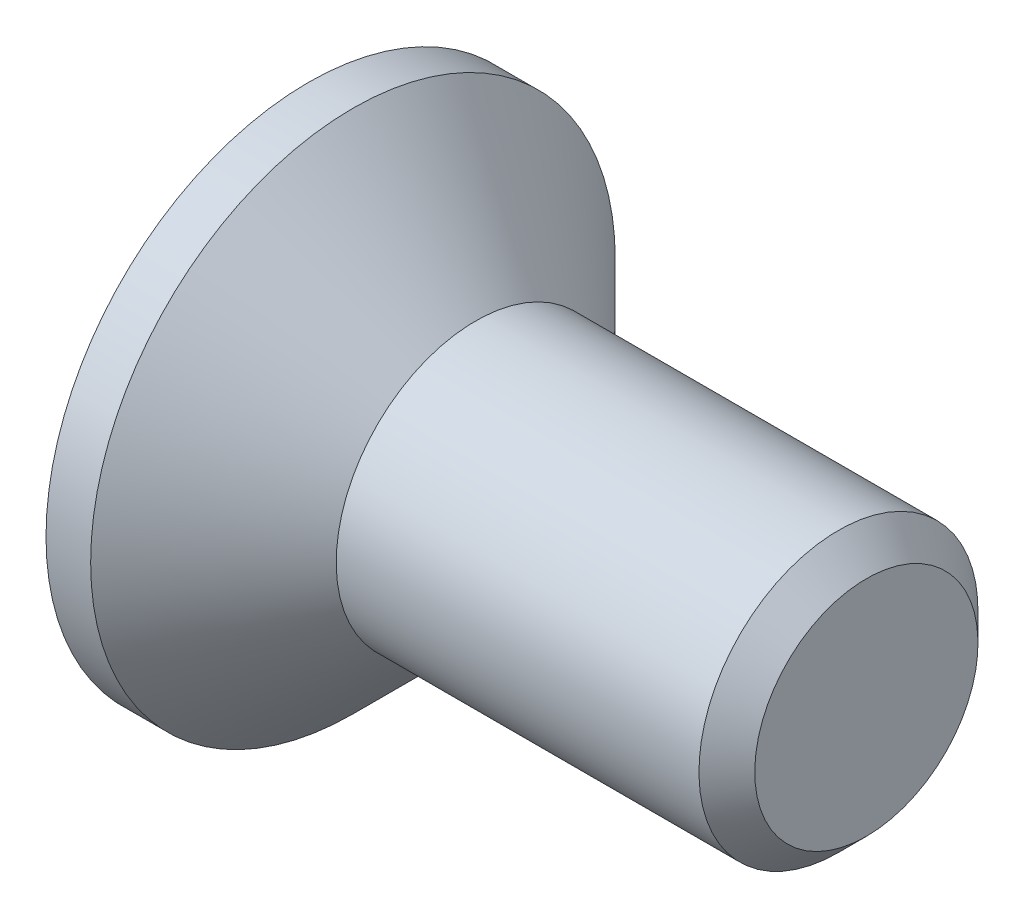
ISO-10303-21;
HEADER;
FILE_DESCRIPTION(('STEP AP214'),'2;1');
FILE_NAME('part.step','',(''),(''),'','','');
FILE_SCHEMA(('AUTOMOTIVE_DESIGN { 1 0 10303 214 1 1 1 1 }'));
ENDSEC;
DATA;
#1=APPLICATION_CONTEXT('core data for automotive mechanical design processes');
#2=APPLICATION_PROTOCOL_DEFINITION('international standard','automotive_design',2000,#1);
#3=PRODUCT_CONTEXT('',#1,'mechanical');
#4=PRODUCT('Part','Part','',(#3));
#5=PRODUCT_RELATED_PRODUCT_CATEGORY('part','',(#4));
#6=PRODUCT_DEFINITION_FORMATION('','',#4);
#7=PRODUCT_DEFINITION_CONTEXT('part definition',#1,'design');
#8=PRODUCT_DEFINITION('design','',#6,#7);
#9=PRODUCT_DEFINITION_SHAPE('','',#8);
#10=(LENGTH_UNIT() NAMED_UNIT(*) SI_UNIT(.MILLI.,.METRE.));
#11=(NAMED_UNIT(*) PLANE_ANGLE_UNIT() SI_UNIT($,.RADIAN.));
#12=(NAMED_UNIT(*) SI_UNIT($,.STERADIAN.) SOLID_ANGLE_UNIT());
#13=UNCERTAINTY_MEASURE_WITH_UNIT(LENGTH_MEASURE(1.E-05),#10,'distance_accuracy_value','');
#14=(GEOMETRIC_REPRESENTATION_CONTEXT(3) GLOBAL_UNCERTAINTY_ASSIGNED_CONTEXT((#13)) GLOBAL_UNIT_ASSIGNED_CONTEXT((#10,
#11,#12)) REPRESENTATION_CONTEXT('',''));
#15=CARTESIAN_POINT('',(0.,0.,0.));
#16=DIRECTION('',(0.,0.,1.));
#17=DIRECTION('',(1.,0.,0.));
#18=AXIS2_PLACEMENT_3D('',#15,#16,#17);
#19=CARTESIAN_POINT('',(0.,0.,0.));
#20=DIRECTION('',(-1.,0.,0.));
#21=DIRECTION('',(0.,-1.,0.));
#22=AXIS2_PLACEMENT_3D('',#19,#20,#21);
#23=CONICAL_SURFACE('',#22,1.25,0.78539816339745);
#24=CARTESIAN_POINT('',(-1.1,0.,0.));
#25=DIRECTION('',(-1.,0.,0.));
#26=DIRECTION('',(0.,-1.,0.));
#27=AXIS2_PLACEMENT_3D('',#24,#25,#26);
#28=CIRCLE('',#27,2.35);
#29=CARTESIAN_POINT('',(-1.1,-2.35,0.));
#30=VERTEX_POINT('',#29);
#31=EDGE_CURVE('E189',#30,#30,#28,.T.);
#32=ORIENTED_EDGE('',*,*,#31,.F.);
#33=EDGE_LOOP('',(#32));
#34=FACE_BOUND('',#33,.T.);
#35=CARTESIAN_POINT('',(0.,0.,0.));
#36=DIRECTION('',(-1.,0.,0.));
#37=DIRECTION('',(0.,-1.,0.));
#38=AXIS2_PLACEMENT_3D('',#35,#36,#37);
#39=CIRCLE('',#38,1.25);
#40=CARTESIAN_POINT('',(0.,-1.25,0.));
#41=VERTEX_POINT('',#40);
#42=EDGE_CURVE('E212',#41,#41,#39,.T.);
#43=ORIENTED_EDGE('',*,*,#42,.T.);
#44=EDGE_LOOP('',(#43));
#45=FACE_BOUND('',#44,.T.);
#46=ADVANCED_FACE('F33',(#34,#45),#23,.T.);
#47=CARTESIAN_POINT('',(-1.5,0.,0.));
#48=DIRECTION('',(-1.,0.,0.));
#49=DIRECTION('',(0.,-1.,0.));
#50=AXIS2_PLACEMENT_3D('',#47,#48,#49);
#51=CYLINDRICAL_SURFACE('',#50,1.25);
#52=CARTESIAN_POINT('',(3.25,0.,0.));
#53=DIRECTION('',(-1.,0.,0.));
#54=DIRECTION('',(0.,-1.,0.));
#55=AXIS2_PLACEMENT_3D('',#52,#53,#54);
#56=CIRCLE('',#55,1.25);
#57=CARTESIAN_POINT('',(3.25,-1.25,0.));
#58=VERTEX_POINT('',#57);
#59=EDGE_CURVE('E41',#58,#58,#56,.T.);
#60=ORIENTED_EDGE('',*,*,#59,.T.);
#61=EDGE_LOOP('',(#60));
#62=FACE_BOUND('',#61,.T.);
#63=ORIENTED_EDGE('',*,*,#42,.F.);
#64=EDGE_LOOP('',(#63));
#65=FACE_BOUND('',#64,.T.);
#66=ADVANCED_FACE('F217',(#62,#65),#51,.T.);
#67=CARTESIAN_POINT('',(3.5,0.,0.));
#68=DIRECTION('',(-1.,0.,0.));
#69=DIRECTION('',(0.,-1.,0.));
#70=AXIS2_PLACEMENT_3D('',#67,#68,#69);
#71=PLANE('',#70);
#72=CARTESIAN_POINT('',(3.5,0.,0.));
#73=DIRECTION('',(-1.,0.,0.));
#74=DIRECTION('',(0.,-1.,0.));
#75=AXIS2_PLACEMENT_3D('',#72,#73,#74);
#76=CIRCLE('',#75,0.999999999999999);
#77=CARTESIAN_POINT('',(3.5,-0.999999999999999,0.));
#78=VERTEX_POINT('',#77);
#79=EDGE_CURVE('E11',#78,#78,#76,.F.);
#80=ORIENTED_EDGE('',*,*,#79,.T.);
#81=EDGE_LOOP('',(#80));
#82=FACE_BOUND('',#81,.T.);
#83=ADVANCED_FACE('F239',(#82),#71,.F.);
#84=CARTESIAN_POINT('',(-1.5,2.35,0.));
#85=DIRECTION('',(1.,0.,0.));
#86=DIRECTION('',(0.,1.,0.));
#87=AXIS2_PLACEMENT_3D('',#84,#85,#86);
#88=PLANE('',#87);
#89=DIRECTION('',(0.,0.,-1.));
#90=VECTOR('',#89,1.);
#91=CARTESIAN_POINT('',(-1.5,0.34,-1.35));
#92=LINE('',#91,#90);
#93=CARTESIAN_POINT('',(-1.5,0.34,-0.34));
#94=VERTEX_POINT('',#93);
#95=CARTESIAN_POINT('',(-1.5,0.34,-1.35));
#96=VERTEX_POINT('',#95);
#97=EDGE_CURVE('E158',#94,#96,#92,.T.);
#98=ORIENTED_EDGE('',*,*,#97,.F.);
#99=DIRECTION('',(0.,-1.,0.));
#100=VECTOR('',#99,1.);
#101=CARTESIAN_POINT('',(-1.5,0.34,-0.34));
#102=LINE('',#101,#100);
#103=CARTESIAN_POINT('',(-1.5,1.35,-0.34));
#104=VERTEX_POINT('',#103);
#105=EDGE_CURVE('E48',#104,#94,#102,.T.);
#106=ORIENTED_EDGE('',*,*,#105,.F.);
#107=DIRECTION('',(0.,0.,-1.));
#108=VECTOR('',#107,1.);
#109=CARTESIAN_POINT('',(-1.5,1.35,-0.34));
#110=LINE('',#109,#108);
#111=CARTESIAN_POINT('',(-1.5,1.35,0.34));
#112=VERTEX_POINT('',#111);
#113=EDGE_CURVE('E185',#112,#104,#110,.T.);
#114=ORIENTED_EDGE('',*,*,#113,.F.);
#115=DIRECTION('',(0.,1.,0.));
#116=VECTOR('',#115,1.);
#117=CARTESIAN_POINT('',(-1.5,1.35,0.34));
#118=LINE('',#117,#116);
#119=CARTESIAN_POINT('',(-1.5,0.34,0.34));
#120=VERTEX_POINT('',#119);
#121=EDGE_CURVE('E183',#120,#112,#118,.T.);
#122=ORIENTED_EDGE('',*,*,#121,.F.);
#123=DIRECTION('',(0.,0.,-1.));
#124=VECTOR('',#123,1.);
#125=CARTESIAN_POINT('',(-1.5,0.34,0.34));
#126=LINE('',#125,#124);
#127=CARTESIAN_POINT('',(-1.5,0.34,1.35));
#128=VERTEX_POINT('',#127);
#129=EDGE_CURVE('E132',#128,#120,#126,.T.);
#130=ORIENTED_EDGE('',*,*,#129,.F.);
#131=DIRECTION('',(0.,1.,0.));
#132=VECTOR('',#131,1.);
#133=CARTESIAN_POINT('',(-1.5,0.34,1.35));
#134=LINE('',#133,#132);
#135=CARTESIAN_POINT('',(-1.5,-0.34,1.35));
#136=VERTEX_POINT('',#135);
#137=EDGE_CURVE('E179',#136,#128,#134,.T.);
#138=ORIENTED_EDGE('',*,*,#137,.F.);
#139=DIRECTION('',(0.,0.,1.));
#140=VECTOR('',#139,1.);
#141=CARTESIAN_POINT('',(-1.5,-0.34,1.35));
#142=LINE('',#141,#140);
#143=CARTESIAN_POINT('',(-1.5,-0.34,0.34));
#144=VERTEX_POINT('',#143);
#145=EDGE_CURVE('E176',#144,#136,#142,.T.);
#146=ORIENTED_EDGE('',*,*,#145,.F.);
#147=DIRECTION('',(0.,1.,0.));
#148=VECTOR('',#147,1.);
#149=CARTESIAN_POINT('',(-1.5,-0.34,0.34));
#150=LINE('',#149,#148);
#151=CARTESIAN_POINT('',(-1.5,-1.35,0.34));
#152=VERTEX_POINT('',#151);
#153=EDGE_CURVE('E173',#152,#144,#150,.T.);
#154=ORIENTED_EDGE('',*,*,#153,.F.);
#155=DIRECTION('',(0.,0.,1.));
#156=VECTOR('',#155,1.);
#157=CARTESIAN_POINT('',(-1.5,-1.35,0.34));
#158=LINE('',#157,#156);
#159=CARTESIAN_POINT('',(-1.5,-1.35,-0.34));
#160=VERTEX_POINT('',#159);
#161=EDGE_CURVE('E170',#160,#152,#158,.T.);
#162=ORIENTED_EDGE('',*,*,#161,.F.);
#163=DIRECTION('',(0.,-1.,0.));
#164=VECTOR('',#163,1.);
#165=CARTESIAN_POINT('',(-1.5,-1.35,-0.34));
#166=LINE('',#165,#164);
#167=CARTESIAN_POINT('',(-1.5,-0.34,-0.34));
#168=VERTEX_POINT('',#167);
#169=EDGE_CURVE('E167',#168,#160,#166,.T.);
#170=ORIENTED_EDGE('',*,*,#169,.F.);
#171=DIRECTION('',(0.,0.,1.));
#172=VECTOR('',#171,1.);
#173=CARTESIAN_POINT('',(-1.5,-0.34,-0.34));
#174=LINE('',#173,#172);
#175=CARTESIAN_POINT('',(-1.5,-0.34,-1.35));
#176=VERTEX_POINT('',#175);
#177=EDGE_CURVE('E164',#176,#168,#174,.T.);
#178=ORIENTED_EDGE('',*,*,#177,.F.);
#179=DIRECTION('',(0.,-1.,0.));
#180=VECTOR('',#179,1.);
#181=CARTESIAN_POINT('',(-1.5,-0.34,-1.35));
#182=LINE('',#181,#180);
#183=EDGE_CURVE('E161',#96,#176,#182,.T.);
#184=ORIENTED_EDGE('',*,*,#183,.F.);
#185=EDGE_LOOP('',(#98,#106,#114,#122,#130,#138,#146,#154,#162,#170,#178,#184));
#186=FACE_BOUND('',#185,.T.);
#187=CARTESIAN_POINT('',(-1.5,0.,0.));
#188=DIRECTION('',(-1.,0.,0.));
#189=DIRECTION('',(0.,-1.,0.));
#190=AXIS2_PLACEMENT_3D('',#187,#188,#189);
#191=CIRCLE('',#190,2.35);
#192=CARTESIAN_POINT('',(-1.5,-2.35,0.));
#193=VERTEX_POINT('',#192);
#194=EDGE_CURVE('E209',#193,#193,#191,.T.);
#195=ORIENTED_EDGE('',*,*,#194,.T.);
#196=EDGE_LOOP('',(#195));
#197=FACE_BOUND('',#196,.T.);
#198=ADVANCED_FACE('F230',(#186,#197),#88,.F.);
#199=CARTESIAN_POINT('',(-1.5,0.,0.));
#200=DIRECTION('',(-1.,0.,0.));
#201=DIRECTION('',(0.,-1.,0.));
#202=AXIS2_PLACEMENT_3D('',#199,#200,#201);
#203=CYLINDRICAL_SURFACE('',#202,2.35);
#204=ORIENTED_EDGE('',*,*,#194,.F.);
#205=EDGE_LOOP('',(#204));
#206=FACE_BOUND('',#205,.T.);
#207=ORIENTED_EDGE('',*,*,#31,.T.);
#208=EDGE_LOOP('',(#207));
#209=FACE_BOUND('',#208,.T.);
#210=ADVANCED_FACE('F222',(#206,#209),#203,.T.);
#211=CARTESIAN_POINT('',(3.25,0.,0.));
#212=DIRECTION('',(-1.,0.,0.));
#213=DIRECTION('',(0.,-1.,0.));
#214=AXIS2_PLACEMENT_3D('',#211,#212,#213);
#215=CONICAL_SURFACE('',#214,1.25,0.785398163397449);
#216=ORIENTED_EDGE('',*,*,#79,.F.);
#217=EDGE_LOOP('',(#216));
#218=FACE_BOUND('',#217,.T.);
#219=ORIENTED_EDGE('',*,*,#59,.F.);
#220=EDGE_LOOP('',(#219));
#221=FACE_BOUND('',#220,.T.);
#222=ADVANCED_FACE('F35',(#218,#221),#215,.T.);
#223=CARTESIAN_POINT('',(-0.25,0.34,-0.34));
#224=DIRECTION('',(0.,0.,-1.));
#225=DIRECTION('',(-1.,0.,0.));
#226=AXIS2_PLACEMENT_3D('',#223,#224,#225);
#227=PLANE('',#226);
#228=ORIENTED_EDGE('',*,*,#105,.T.);
#229=DIRECTION('',(-1.,0.,0.));
#230=VECTOR('',#229,1.);
#231=CARTESIAN_POINT('',(-0.25,0.34,-0.34));
#232=LINE('',#231,#230);
#233=CARTESIAN_POINT('',(-0.25,0.34,-0.34));
#234=VERTEX_POINT('',#233);
#235=EDGE_CURVE('E96',#234,#94,#232,.T.);
#236=ORIENTED_EDGE('',*,*,#235,.F.);
#237=DIRECTION('',(0.,-1.,0.));
#238=VECTOR('',#237,1.);
#239=CARTESIAN_POINT('',(-0.25,0.34,-0.34));
#240=LINE('',#239,#238);
#241=CARTESIAN_POINT('',(-0.25,1.35,-0.34));
#242=VERTEX_POINT('',#241);
#243=EDGE_CURVE('E187',#242,#234,#240,.T.);
#244=ORIENTED_EDGE('',*,*,#243,.F.);
#245=DIRECTION('',(-1.,0.,0.));
#246=VECTOR('',#245,1.);
#247=CARTESIAN_POINT('',(-0.25,1.35,-0.34));
#248=LINE('',#247,#246);
#249=EDGE_CURVE('E56',#242,#104,#248,.T.);
#250=ORIENTED_EDGE('',*,*,#249,.T.);
#251=EDGE_LOOP('',(#228,#236,#244,#250));
#252=FACE_BOUND('',#251,.T.);
#253=ADVANCED_FACE('F221',(#252),#227,.F.);
#254=CARTESIAN_POINT('',(-0.25,1.35,-0.34));
#255=DIRECTION('',(0.,1.,0.));
#256=DIRECTION('',(-1.,0.,0.));
#257=AXIS2_PLACEMENT_3D('',#254,#255,#256);
#258=PLANE('',#257);
#259=ORIENTED_EDGE('',*,*,#113,.T.);
#260=ORIENTED_EDGE('',*,*,#249,.F.);
#261=DIRECTION('',(0.,0.,-1.));
#262=VECTOR('',#261,1.);
#263=CARTESIAN_POINT('',(-0.25,1.35,-0.34));
#264=LINE('',#263,#262);
#265=CARTESIAN_POINT('',(-0.25,1.35,0.34));
#266=VERTEX_POINT('',#265);
#267=EDGE_CURVE('E144',#266,#242,#264,.T.);
#268=ORIENTED_EDGE('',*,*,#267,.F.);
#269=DIRECTION('',(-1.,0.,0.));
#270=VECTOR('',#269,1.);
#271=CARTESIAN_POINT('',(-0.25,1.35,0.34));
#272=LINE('',#271,#270);
#273=EDGE_CURVE('E136',#266,#112,#272,.T.);
#274=ORIENTED_EDGE('',*,*,#273,.T.);
#275=EDGE_LOOP('',(#259,#260,#268,#274));
#276=FACE_BOUND('',#275,.T.);
#277=ADVANCED_FACE('F228',(#276),#258,.F.);
#278=CARTESIAN_POINT('',(-0.25,1.35,0.34));
#279=DIRECTION('',(0.,0.,1.));
#280=DIRECTION('',(1.,0.,0.));
#281=AXIS2_PLACEMENT_3D('',#278,#279,#280);
#282=PLANE('',#281);
#283=ORIENTED_EDGE('',*,*,#121,.T.);
#284=ORIENTED_EDGE('',*,*,#273,.F.);
#285=DIRECTION('',(0.,1.,0.));
#286=VECTOR('',#285,1.);
#287=CARTESIAN_POINT('',(-0.25,1.35,0.34));
#288=LINE('',#287,#286);
#289=CARTESIAN_POINT('',(-0.25,0.34,0.34));
#290=VERTEX_POINT('',#289);
#291=EDGE_CURVE('E140',#290,#266,#288,.T.);
#292=ORIENTED_EDGE('',*,*,#291,.F.);
#293=DIRECTION('',(-1.,0.,0.));
#294=VECTOR('',#293,1.);
#295=CARTESIAN_POINT('',(-0.25,0.34,0.34));
#296=LINE('',#295,#294);
#297=EDGE_CURVE('E125',#290,#120,#296,.T.);
#298=ORIENTED_EDGE('',*,*,#297,.T.);
#299=EDGE_LOOP('',(#283,#284,#292,#298));
#300=FACE_BOUND('',#299,.T.);
#301=ADVANCED_FACE('F141',(#300),#282,.F.);
#302=CARTESIAN_POINT('',(-0.25,0.34,0.34));
#303=DIRECTION('',(0.,1.,0.));
#304=DIRECTION('',(-1.,0.,0.));
#305=AXIS2_PLACEMENT_3D('',#302,#303,#304);
#306=PLANE('',#305);
#307=ORIENTED_EDGE('',*,*,#129,.T.);
#308=ORIENTED_EDGE('',*,*,#297,.F.);
#309=DIRECTION('',(0.,0.,-1.));
#310=VECTOR('',#309,1.);
#311=CARTESIAN_POINT('',(-0.25,0.34,0.34));
#312=LINE('',#311,#310);
#313=CARTESIAN_POINT('',(-0.25,0.34,1.35));
#314=VERTEX_POINT('',#313);
#315=EDGE_CURVE('E129',#314,#290,#312,.T.);
#316=ORIENTED_EDGE('',*,*,#315,.F.);
#317=DIRECTION('',(-1.,0.,0.));
#318=VECTOR('',#317,1.);
#319=CARTESIAN_POINT('',(-0.25,0.34,1.35));
#320=LINE('',#319,#318);
#321=EDGE_CURVE('E137',#314,#128,#320,.T.);
#322=ORIENTED_EDGE('',*,*,#321,.T.);
#323=EDGE_LOOP('',(#307,#308,#316,#322));
#324=FACE_BOUND('',#323,.T.);
#325=ADVANCED_FACE('F127',(#324),#306,.F.);
#326=CARTESIAN_POINT('',(-0.25,0.34,1.35));
#327=DIRECTION('',(0.,0.,1.));
#328=DIRECTION('',(1.,0.,0.));
#329=AXIS2_PLACEMENT_3D('',#326,#327,#328);
#330=PLANE('',#329);
#331=ORIENTED_EDGE('',*,*,#137,.T.);
#332=ORIENTED_EDGE('',*,*,#321,.F.);
#333=DIRECTION('',(0.,1.,0.));
#334=VECTOR('',#333,1.);
#335=CARTESIAN_POINT('',(-0.25,0.34,1.35));
#336=LINE('',#335,#334);
#337=CARTESIAN_POINT('',(-0.25,-0.34,1.35));
#338=VERTEX_POINT('',#337);
#339=EDGE_CURVE('E150',#338,#314,#336,.T.);
#340=ORIENTED_EDGE('',*,*,#339,.F.);
#341=DIRECTION('',(-1.,0.,0.));
#342=VECTOR('',#341,1.);
#343=CARTESIAN_POINT('',(-0.25,-0.34,1.35));
#344=LINE('',#343,#342);
#345=EDGE_CURVE('E192',#338,#136,#344,.T.);
#346=ORIENTED_EDGE('',*,*,#345,.T.);
#347=EDGE_LOOP('',(#331,#332,#340,#346));
#348=FACE_BOUND('',#347,.T.);
#349=ADVANCED_FACE('F277',(#348),#330,.F.);
#350=CARTESIAN_POINT('',(-0.25,-0.34,1.35));
#351=DIRECTION('',(0.,-1.,0.));
#352=DIRECTION('',(1.,0.,0.));
#353=AXIS2_PLACEMENT_3D('',#350,#351,#352);
#354=PLANE('',#353);
#355=ORIENTED_EDGE('',*,*,#145,.T.);
#356=ORIENTED_EDGE('',*,*,#345,.F.);
#357=DIRECTION('',(0.,0.,1.));
#358=VECTOR('',#357,1.);
#359=CARTESIAN_POINT('',(-0.25,-0.34,1.35));
#360=LINE('',#359,#358);
#361=CARTESIAN_POINT('',(-0.25,-0.34,0.34));
#362=VERTEX_POINT('',#361);
#363=EDGE_CURVE('E152',#362,#338,#360,.T.);
#364=ORIENTED_EDGE('',*,*,#363,.F.);
#365=DIRECTION('',(-1.,0.,0.));
#366=VECTOR('',#365,1.);
#367=CARTESIAN_POINT('',(-0.25,-0.34,0.34));
#368=LINE('',#367,#366);
#369=EDGE_CURVE('E194',#362,#144,#368,.T.);
#370=ORIENTED_EDGE('',*,*,#369,.T.);
#371=EDGE_LOOP('',(#355,#356,#364,#370));
#372=FACE_BOUND('',#371,.T.);
#373=ADVANCED_FACE('F273',(#372),#354,.F.);
#374=CARTESIAN_POINT('',(-0.25,-0.34,0.34));
#375=DIRECTION('',(0.,0.,1.));
#376=DIRECTION('',(1.,0.,0.));
#377=AXIS2_PLACEMENT_3D('',#374,#375,#376);
#378=PLANE('',#377);
#379=ORIENTED_EDGE('',*,*,#153,.T.);
#380=ORIENTED_EDGE('',*,*,#369,.F.);
#381=DIRECTION('',(0.,1.,0.));
#382=VECTOR('',#381,1.);
#383=CARTESIAN_POINT('',(-0.25,-0.34,0.34));
#384=LINE('',#383,#382);
#385=CARTESIAN_POINT('',(-0.25,-1.35,0.34));
#386=VERTEX_POINT('',#385);
#387=EDGE_CURVE('E422',#386,#362,#384,.T.);
#388=ORIENTED_EDGE('',*,*,#387,.F.);
#389=DIRECTION('',(-1.,0.,0.));
#390=VECTOR('',#389,1.);
#391=CARTESIAN_POINT('',(-0.25,-1.35,0.34));
#392=LINE('',#391,#390);
#393=EDGE_CURVE('E196',#386,#152,#392,.T.);
#394=ORIENTED_EDGE('',*,*,#393,.T.);
#395=EDGE_LOOP('',(#379,#380,#388,#394));
#396=FACE_BOUND('',#395,.T.);
#397=ADVANCED_FACE('F269',(#396),#378,.F.);
#398=CARTESIAN_POINT('',(-0.25,-1.35,0.34));
#399=DIRECTION('',(0.,-1.,0.));
#400=DIRECTION('',(1.,0.,0.));
#401=AXIS2_PLACEMENT_3D('',#398,#399,#400);
#402=PLANE('',#401);
#403=ORIENTED_EDGE('',*,*,#161,.T.);
#404=ORIENTED_EDGE('',*,*,#393,.F.);
#405=DIRECTION('',(0.,0.,1.));
#406=VECTOR('',#405,1.);
#407=CARTESIAN_POINT('',(-0.25,-1.35,0.34));
#408=LINE('',#407,#406);
#409=CARTESIAN_POINT('',(-0.25,-1.35,-0.34));
#410=VERTEX_POINT('',#409);
#411=EDGE_CURVE('E419',#410,#386,#408,.T.);
#412=ORIENTED_EDGE('',*,*,#411,.F.);
#413=DIRECTION('',(-1.,0.,0.));
#414=VECTOR('',#413,1.);
#415=CARTESIAN_POINT('',(-0.25,-1.35,-0.34));
#416=LINE('',#415,#414);
#417=EDGE_CURVE('E198',#410,#160,#416,.T.);
#418=ORIENTED_EDGE('',*,*,#417,.T.);
#419=EDGE_LOOP('',(#403,#404,#412,#418));
#420=FACE_BOUND('',#419,.T.);
#421=ADVANCED_FACE('F265',(#420),#402,.F.);
#422=CARTESIAN_POINT('',(-0.25,-1.35,-0.34));
#423=DIRECTION('',(0.,0.,-1.));
#424=DIRECTION('',(-1.,0.,0.));
#425=AXIS2_PLACEMENT_3D('',#422,#423,#424);
#426=PLANE('',#425);
#427=ORIENTED_EDGE('',*,*,#169,.T.);
#428=ORIENTED_EDGE('',*,*,#417,.F.);
#429=DIRECTION('',(0.,-1.,0.));
#430=VECTOR('',#429,1.);
#431=CARTESIAN_POINT('',(-0.25,-1.35,-0.34));
#432=LINE('',#431,#430);
#433=CARTESIAN_POINT('',(-0.25,-0.34,-0.34));
#434=VERTEX_POINT('',#433);
#435=EDGE_CURVE('E416',#434,#410,#432,.T.);
#436=ORIENTED_EDGE('',*,*,#435,.F.);
#437=DIRECTION('',(-1.,0.,0.));
#438=VECTOR('',#437,1.);
#439=CARTESIAN_POINT('',(-0.25,-0.34,-0.34));
#440=LINE('',#439,#438);
#441=EDGE_CURVE('E200',#434,#168,#440,.T.);
#442=ORIENTED_EDGE('',*,*,#441,.T.);
#443=EDGE_LOOP('',(#427,#428,#436,#442));
#444=FACE_BOUND('',#443,.T.);
#445=ADVANCED_FACE('F261',(#444),#426,.F.);
#446=CARTESIAN_POINT('',(-0.25,-0.34,-0.34));
#447=DIRECTION('',(0.,-1.,0.));
#448=DIRECTION('',(1.,0.,0.));
#449=AXIS2_PLACEMENT_3D('',#446,#447,#448);
#450=PLANE('',#449);
#451=ORIENTED_EDGE('',*,*,#177,.T.);
#452=ORIENTED_EDGE('',*,*,#441,.F.);
#453=DIRECTION('',(0.,0.,1.));
#454=VECTOR('',#453,1.);
#455=CARTESIAN_POINT('',(-0.25,-0.34,-0.34));
#456=LINE('',#455,#454);
#457=CARTESIAN_POINT('',(-0.25,-0.34,-1.35));
#458=VERTEX_POINT('',#457);
#459=EDGE_CURVE('E413',#458,#434,#456,.T.);
#460=ORIENTED_EDGE('',*,*,#459,.F.);
#461=DIRECTION('',(-1.,0.,0.));
#462=VECTOR('',#461,1.);
#463=CARTESIAN_POINT('',(-0.25,-0.34,-1.35));
#464=LINE('',#463,#462);
#465=EDGE_CURVE('E202',#458,#176,#464,.T.);
#466=ORIENTED_EDGE('',*,*,#465,.T.);
#467=EDGE_LOOP('',(#451,#452,#460,#466));
#468=FACE_BOUND('',#467,.T.);
#469=ADVANCED_FACE('F257',(#468),#450,.F.);
#470=CARTESIAN_POINT('',(-0.25,-0.34,-1.35));
#471=DIRECTION('',(0.,0.,-1.));
#472=DIRECTION('',(-1.,0.,0.));
#473=AXIS2_PLACEMENT_3D('',#470,#471,#472);
#474=PLANE('',#473);
#475=ORIENTED_EDGE('',*,*,#183,.T.);
#476=ORIENTED_EDGE('',*,*,#465,.F.);
#477=DIRECTION('',(0.,-1.,0.));
#478=VECTOR('',#477,1.);
#479=CARTESIAN_POINT('',(-0.25,-0.34,-1.35));
#480=LINE('',#479,#478);
#481=CARTESIAN_POINT('',(-0.25,0.34,-1.35));
#482=VERTEX_POINT('',#481);
#483=EDGE_CURVE('E408',#482,#458,#480,.T.);
#484=ORIENTED_EDGE('',*,*,#483,.F.);
#485=DIRECTION('',(-1.,0.,0.));
#486=VECTOR('',#485,1.);
#487=CARTESIAN_POINT('',(-0.25,0.34,-1.35));
#488=LINE('',#487,#486);
#489=EDGE_CURVE('E204',#482,#96,#488,.T.);
#490=ORIENTED_EDGE('',*,*,#489,.T.);
#491=EDGE_LOOP('',(#475,#476,#484,#490));
#492=FACE_BOUND('',#491,.T.);
#493=ADVANCED_FACE('F253',(#492),#474,.F.);
#494=CARTESIAN_POINT('',(-0.25,0.34,-1.35));
#495=DIRECTION('',(0.,1.,0.));
#496=DIRECTION('',(-1.,0.,0.));
#497=AXIS2_PLACEMENT_3D('',#494,#495,#496);
#498=PLANE('',#497);
#499=ORIENTED_EDGE('',*,*,#97,.T.);
#500=ORIENTED_EDGE('',*,*,#489,.F.);
#501=DIRECTION('',(0.,0.,-1.));
#502=VECTOR('',#501,1.);
#503=CARTESIAN_POINT('',(-0.25,0.34,-1.35));
#504=LINE('',#503,#502);
#505=EDGE_CURVE('E406',#234,#482,#504,.T.);
#506=ORIENTED_EDGE('',*,*,#505,.F.);
#507=ORIENTED_EDGE('',*,*,#235,.T.);
#508=EDGE_LOOP('',(#499,#500,#506,#507));
#509=FACE_BOUND('',#508,.T.);
#510=ADVANCED_FACE('F250',(#509),#498,.F.);
#511=CARTESIAN_POINT('',(-0.25,0.,0.));
#512=DIRECTION('',(1.,0.,0.));
#513=DIRECTION('',(0.,0.,-1.));
#514=AXIS2_PLACEMENT_3D('',#511,#512,#513);
#515=PLANE('',#514);
#516=ORIENTED_EDGE('',*,*,#243,.T.);
#517=ORIENTED_EDGE('',*,*,#505,.T.);
#518=ORIENTED_EDGE('',*,*,#483,.T.);
#519=ORIENTED_EDGE('',*,*,#459,.T.);
#520=ORIENTED_EDGE('',*,*,#435,.T.);
#521=ORIENTED_EDGE('',*,*,#411,.T.);
#522=ORIENTED_EDGE('',*,*,#387,.T.);
#523=ORIENTED_EDGE('',*,*,#363,.T.);
#524=ORIENTED_EDGE('',*,*,#339,.T.);
#525=ORIENTED_EDGE('',*,*,#315,.T.);
#526=ORIENTED_EDGE('',*,*,#291,.T.);
#527=ORIENTED_EDGE('',*,*,#267,.T.);
#528=EDGE_LOOP('',(#516,#517,#518,#519,#520,#521,#522,#523,#524,#525,#526,#527));
#529=FACE_BOUND('',#528,.T.);
#530=ADVANCED_FACE('F147',(#529),#515,.F.);
#531=CLOSED_SHELL('',(#46,#66,#83,#198,#210,#222,#253,#277,#301,#325,#349,#373,#397,#421,#445,
#469,#493,#510,#530));
#532=MANIFOLD_SOLID_BREP('B2',#531);
#533=ADVANCED_BREP_SHAPE_REPRESENTATION('',(#18,#532),#14);
#534=SHAPE_DEFINITION_REPRESENTATION(#9,#533);
ENDSEC;
END-ISO-10303-21;
